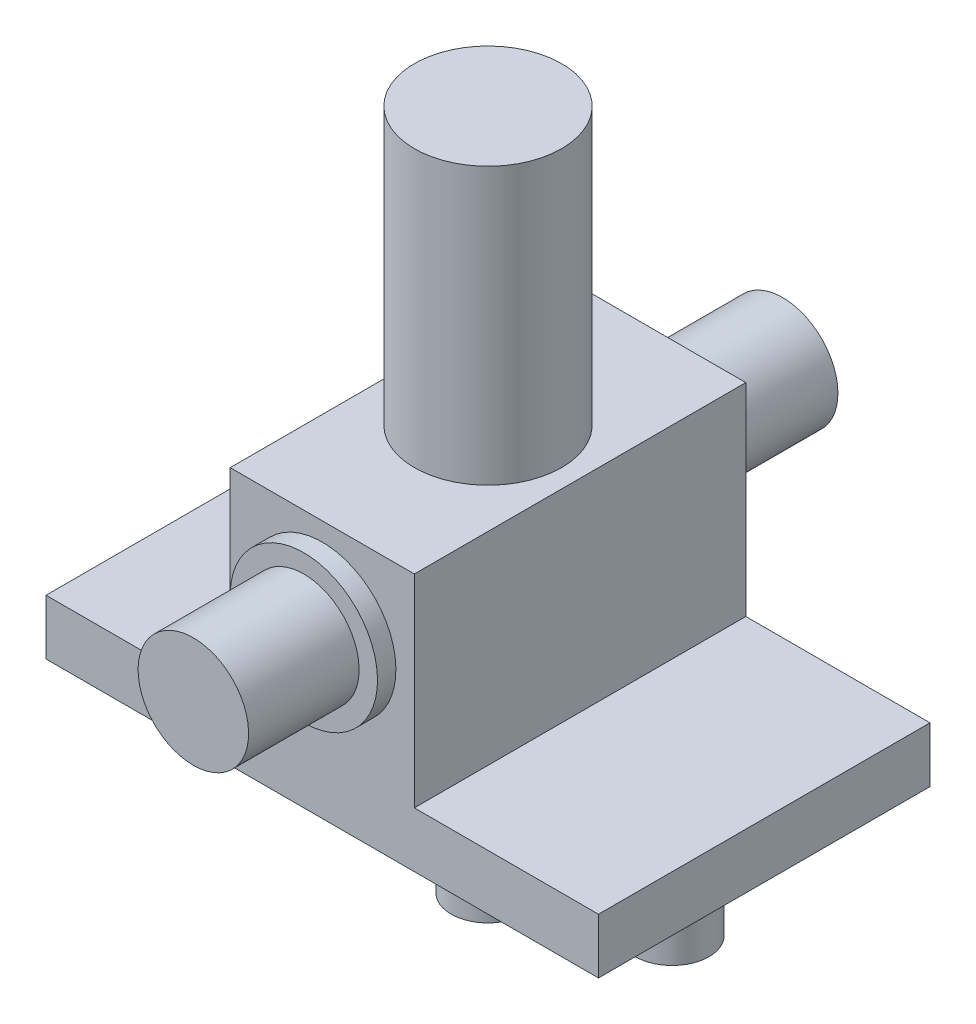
ISO-10303-21;
HEADER;
FILE_DESCRIPTION(('STEP AP214'),'2;1');
FILE_NAME('part.step','',(''),(''),'','','');
FILE_SCHEMA(('AUTOMOTIVE_DESIGN { 1 0 10303 214 1 1 1 1 }'));
ENDSEC;
DATA;
#1=APPLICATION_CONTEXT('core data for automotive mechanical design processes');
#2=APPLICATION_PROTOCOL_DEFINITION('international standard','automotive_design',2000,#1);
#3=PRODUCT_CONTEXT('',#1,'mechanical');
#4=PRODUCT('Part','Part','',(#3));
#5=PRODUCT_RELATED_PRODUCT_CATEGORY('part','',(#4));
#6=PRODUCT_DEFINITION_FORMATION('','',#4);
#7=PRODUCT_DEFINITION_CONTEXT('part definition',#1,'design');
#8=PRODUCT_DEFINITION('design','',#6,#7);
#9=PRODUCT_DEFINITION_SHAPE('','',#8);
#10=(LENGTH_UNIT() NAMED_UNIT(*) SI_UNIT(.MILLI.,.METRE.));
#11=(NAMED_UNIT(*) PLANE_ANGLE_UNIT() SI_UNIT($,.RADIAN.));
#12=(NAMED_UNIT(*) SI_UNIT($,.STERADIAN.) SOLID_ANGLE_UNIT());
#13=UNCERTAINTY_MEASURE_WITH_UNIT(LENGTH_MEASURE(1.E-05),#10,'distance_accuracy_value','');
#14=(GEOMETRIC_REPRESENTATION_CONTEXT(3) GLOBAL_UNCERTAINTY_ASSIGNED_CONTEXT((#13)) GLOBAL_UNIT_ASSIGNED_CONTEXT((#10,
#11,#12)) REPRESENTATION_CONTEXT('',''));
#15=CARTESIAN_POINT('',(0.,0.,0.));
#16=DIRECTION('',(0.,0.,1.));
#17=DIRECTION('',(1.,0.,0.));
#18=AXIS2_PLACEMENT_3D('',#15,#16,#17);
#19=CARTESIAN_POINT('',(0.,7.,0.));
#20=DIRECTION('',(0.,1.,0.));
#21=DIRECTION('',(1.,0.,0.));
#22=AXIS2_PLACEMENT_3D('',#19,#20,#21);
#23=PLANE('',#22);
#24=CARTESIAN_POINT('',(0.,7.,0.));
#25=DIRECTION('',(0.,-1.,0.));
#26=DIRECTION('',(-1.,0.,0.));
#27=AXIS2_PLACEMENT_3D('',#24,#25,#26);
#28=CIRCLE('',#27,4.);
#29=CARTESIAN_POINT('',(4.,7.,0.));
#30=VERTEX_POINT('',#29);
#31=EDGE_CURVE('E781',#30,#30,#28,.T.);
#32=ORIENTED_EDGE('',*,*,#31,.T.);
#33=EDGE_LOOP('',(#32));
#34=FACE_BOUND('',#33,.T.);
#35=DIRECTION('',(0.,0.,1.));
#36=VECTOR('',#35,1.);
#37=CARTESIAN_POINT('',(-5.,7.,-9.));
#38=LINE('',#37,#36);
#39=CARTESIAN_POINT('',(-5.,7.,-9.));
#40=VERTEX_POINT('',#39);
#41=CARTESIAN_POINT('',(-5.,7.,9.));
#42=VERTEX_POINT('',#41);
#43=EDGE_CURVE('E773',#40,#42,#38,.T.);
#44=ORIENTED_EDGE('',*,*,#43,.T.);
#45=DIRECTION('',(1.,0.,0.));
#46=VECTOR('',#45,1.);
#47=CARTESIAN_POINT('',(-5.,7.,9.));
#48=LINE('',#47,#46);
#49=CARTESIAN_POINT('',(5.,7.,9.));
#50=VERTEX_POINT('',#49);
#51=EDGE_CURVE('E252',#42,#50,#48,.T.);
#52=ORIENTED_EDGE('',*,*,#51,.T.);
#53=DIRECTION('',(0.,0.,-1.));
#54=VECTOR('',#53,1.);
#55=CARTESIAN_POINT('',(5.,7.,9.));
#56=LINE('',#55,#54);
#57=CARTESIAN_POINT('',(5.,7.,-9.));
#58=VERTEX_POINT('',#57);
#59=EDGE_CURVE('E207',#50,#58,#56,.T.);
#60=ORIENTED_EDGE('',*,*,#59,.T.);
#61=DIRECTION('',(-1.,0.,0.));
#62=VECTOR('',#61,1.);
#63=CARTESIAN_POINT('',(5.,7.,-9.));
#64=LINE('',#63,#62);
#65=EDGE_CURVE('E253',#58,#40,#64,.T.);
#66=ORIENTED_EDGE('',*,*,#65,.T.);
#67=EDGE_LOOP('',(#44,#52,#60,#66));
#68=FACE_BOUND('',#67,.T.);
#69=ADVANCED_FACE('F15',(#34,#68),#23,.T.);
#70=CARTESIAN_POINT('',(15.,-7.,0.));
#71=DIRECTION('',(0.,-1.,0.));
#72=DIRECTION('',(0.,0.,-1.));
#73=AXIS2_PLACEMENT_3D('',#70,#71,#72);
#74=PLANE('',#73);
#75=CARTESIAN_POINT('',(10.,-7.,0.));
#76=DIRECTION('',(0.,1.,0.));
#77=DIRECTION('',(-1.,0.,0.));
#78=AXIS2_PLACEMENT_3D('',#75,#76,#77);
#79=CIRCLE('',#78,3.);
#80=CARTESIAN_POINT('',(13.,-7.,0.));
#81=VERTEX_POINT('',#80);
#82=EDGE_CURVE('E299',#81,#81,#79,.T.);
#83=ORIENTED_EDGE('',*,*,#82,.T.);
#84=EDGE_LOOP('',(#83));
#85=FACE_BOUND('',#84,.T.);
#86=CARTESIAN_POINT('',(-10.,-7.,0.));
#87=DIRECTION('',(0.,1.,0.));
#88=DIRECTION('',(1.,0.,0.));
#89=AXIS2_PLACEMENT_3D('',#86,#87,#88);
#90=CIRCLE('',#89,3.);
#91=CARTESIAN_POINT('',(-13.,-7.,0.));
#92=VERTEX_POINT('',#91);
#93=EDGE_CURVE('E287',#92,#92,#90,.T.);
#94=ORIENTED_EDGE('',*,*,#93,.T.);
#95=EDGE_LOOP('',(#94));
#96=FACE_BOUND('',#95,.T.);
#97=CARTESIAN_POINT('',(0.,-7.,0.));
#98=DIRECTION('',(0.,1.,0.));
#99=DIRECTION('',(-1.,0.,0.));
#100=AXIS2_PLACEMENT_3D('',#97,#98,#99);
#101=CIRCLE('',#100,2.);
#102=CARTESIAN_POINT('',(2.,-7.,0.));
#103=VERTEX_POINT('',#102);
#104=EDGE_CURVE('E263',#103,#103,#101,.T.);
#105=ORIENTED_EDGE('',*,*,#104,.T.);
#106=EDGE_LOOP('',(#105));
#107=FACE_BOUND('',#106,.T.);
#108=DIRECTION('',(-1.,0.,0.));
#109=VECTOR('',#108,1.);
#110=CARTESIAN_POINT('',(15.,-7.,9.));
#111=LINE('',#110,#109);
#112=CARTESIAN_POINT('',(15.,-7.,9.));
#113=VERTEX_POINT('',#112);
#114=CARTESIAN_POINT('',(-15.,-7.,9.));
#115=VERTEX_POINT('',#114);
#116=EDGE_CURVE('E247',#113,#115,#111,.T.);
#117=ORIENTED_EDGE('',*,*,#116,.T.);
#118=DIRECTION('',(0.,0.,-1.));
#119=VECTOR('',#118,1.);
#120=CARTESIAN_POINT('',(-15.,-7.,9.));
#121=LINE('',#120,#119);
#122=CARTESIAN_POINT('',(-15.,-7.,-9.));
#123=VERTEX_POINT('',#122);
#124=EDGE_CURVE('E240',#115,#123,#121,.T.);
#125=ORIENTED_EDGE('',*,*,#124,.T.);
#126=DIRECTION('',(1.,0.,0.));
#127=VECTOR('',#126,1.);
#128=CARTESIAN_POINT('',(-15.,-7.,-9.));
#129=LINE('',#128,#127);
#130=CARTESIAN_POINT('',(15.,-7.,-9.));
#131=VERTEX_POINT('',#130);
#132=EDGE_CURVE('E19',#123,#131,#129,.T.);
#133=ORIENTED_EDGE('',*,*,#132,.T.);
#134=DIRECTION('',(0.,0.,-1.));
#135=VECTOR('',#134,1.);
#136=CARTESIAN_POINT('',(15.,-7.,9.));
#137=LINE('',#136,#135);
#138=EDGE_CURVE('E9',#113,#131,#137,.T.);
#139=ORIENTED_EDGE('',*,*,#138,.F.);
#140=EDGE_LOOP('',(#117,#125,#133,#139));
#141=FACE_BOUND('',#140,.T.);
#142=ADVANCED_FACE('F317',(#85,#96,#107,#141),#74,.T.);
#143=CARTESIAN_POINT('',(15.,0.,0.));
#144=DIRECTION('',(1.,0.,0.));
#145=DIRECTION('',(0.,1.,0.));
#146=AXIS2_PLACEMENT_3D('',#143,#144,#145);
#147=PLANE('',#146);
#148=DIRECTION('',(0.,0.,1.));
#149=VECTOR('',#148,1.);
#150=CARTESIAN_POINT('',(15.,-4.,-9.));
#151=LINE('',#150,#149);
#152=CARTESIAN_POINT('',(15.,-4.,-9.));
#153=VERTEX_POINT('',#152);
#154=CARTESIAN_POINT('',(15.,-4.,9.));
#155=VERTEX_POINT('',#154);
#156=EDGE_CURVE('E193',#153,#155,#151,.T.);
#157=ORIENTED_EDGE('',*,*,#156,.T.);
#158=DIRECTION('',(0.,-1.,0.));
#159=VECTOR('',#158,1.);
#160=CARTESIAN_POINT('',(15.,-4.,9.));
#161=LINE('',#160,#159);
#162=EDGE_CURVE('E188',#155,#113,#161,.T.);
#163=ORIENTED_EDGE('',*,*,#162,.T.);
#164=ORIENTED_EDGE('',*,*,#138,.T.);
#165=DIRECTION('',(0.,1.,0.));
#166=VECTOR('',#165,1.);
#167=CARTESIAN_POINT('',(15.,-7.,-9.));
#168=LINE('',#167,#166);
#169=EDGE_CURVE('E256',#131,#153,#168,.T.);
#170=ORIENTED_EDGE('',*,*,#169,.T.);
#171=EDGE_LOOP('',(#157,#163,#164,#170));
#172=FACE_BOUND('',#171,.T.);
#173=ADVANCED_FACE('F17',(#172),#147,.T.);
#174=CARTESIAN_POINT('',(0.,0.,-9.));
#175=DIRECTION('',(0.,0.,1.));
#176=DIRECTION('',(1.,0.,0.));
#177=AXIS2_PLACEMENT_3D('',#174,#175,#176);
#178=PLANE('',#177);
#179=CARTESIAN_POINT('',(0.,2.,-9.));
#180=DIRECTION('',(0.,0.,1.));
#181=DIRECTION('',(0.,-1.,0.));
#182=AXIS2_PLACEMENT_3D('',#179,#180,#181);
#183=CIRCLE('',#182,4.);
#184=CARTESIAN_POINT('',(0.,-2.,-9.));
#185=VERTEX_POINT('',#184);
#186=EDGE_CURVE('E269',#185,#185,#183,.T.);
#187=ORIENTED_EDGE('',*,*,#186,.T.);
#188=EDGE_LOOP('',(#187));
#189=FACE_BOUND('',#188,.T.);
#190=DIRECTION('',(0.,1.,0.));
#191=VECTOR('',#190,1.);
#192=CARTESIAN_POINT('',(-5.,-4.,-9.));
#193=LINE('',#192,#191);
#194=CARTESIAN_POINT('',(-5.,-4.,-9.));
#195=VERTEX_POINT('',#194);
#196=EDGE_CURVE('E229',#195,#40,#193,.T.);
#197=ORIENTED_EDGE('',*,*,#196,.T.);
#198=ORIENTED_EDGE('',*,*,#65,.F.);
#199=DIRECTION('',(0.,-1.,0.));
#200=VECTOR('',#199,1.);
#201=CARTESIAN_POINT('',(5.,7.,-9.));
#202=LINE('',#201,#200);
#203=CARTESIAN_POINT('',(5.,-4.,-9.));
#204=VERTEX_POINT('',#203);
#205=EDGE_CURVE('E214',#58,#204,#202,.T.);
#206=ORIENTED_EDGE('',*,*,#205,.T.);
#207=DIRECTION('',(1.,0.,0.));
#208=VECTOR('',#207,1.);
#209=CARTESIAN_POINT('',(5.,-4.,-9.));
#210=LINE('',#209,#208);
#211=EDGE_CURVE('E194',#204,#153,#210,.T.);
#212=ORIENTED_EDGE('',*,*,#211,.T.);
#213=ORIENTED_EDGE('',*,*,#169,.F.);
#214=ORIENTED_EDGE('',*,*,#132,.F.);
#215=DIRECTION('',(0.,-1.,0.));
#216=VECTOR('',#215,1.);
#217=CARTESIAN_POINT('',(-15.,-4.,-9.));
#218=LINE('',#217,#216);
#219=CARTESIAN_POINT('',(-15.,-4.,-9.));
#220=VERTEX_POINT('',#219);
#221=EDGE_CURVE('E236',#220,#123,#218,.T.);
#222=ORIENTED_EDGE('',*,*,#221,.F.);
#223=DIRECTION('',(1.,0.,0.));
#224=VECTOR('',#223,1.);
#225=CARTESIAN_POINT('',(-15.,-4.,-9.));
#226=LINE('',#225,#224);
#227=EDGE_CURVE('E224',#220,#195,#226,.T.);
#228=ORIENTED_EDGE('',*,*,#227,.T.);
#229=EDGE_LOOP('',(#197,#198,#206,#212,#213,#214,#222,#228));
#230=FACE_BOUND('',#229,.T.);
#231=ADVANCED_FACE('F320',(#189,#230),#178,.F.);
#232=CARTESIAN_POINT('',(0.,0.5,16.));
#233=DIRECTION('',(0.,0.,1.));
#234=DIRECTION('',(1.,0.,0.));
#235=AXIS2_PLACEMENT_3D('',#232,#233,#234);
#236=PLANE('',#235);
#237=CARTESIAN_POINT('',(0.,2.,16.));
#238=DIRECTION('',(0.,0.,1.));
#239=DIRECTION('',(0.,-1.,0.));
#240=AXIS2_PLACEMENT_3D('',#237,#238,#239);
#241=CIRCLE('',#240,3.);
#242=CARTESIAN_POINT('',(0.,-1.,16.));
#243=VERTEX_POINT('',#242);
#244=EDGE_CURVE('E43',#243,#243,#241,.T.);
#245=ORIENTED_EDGE('',*,*,#244,.T.);
#246=EDGE_LOOP('',(#245));
#247=FACE_BOUND('',#246,.T.);
#248=ADVANCED_FACE('F470',(#247),#236,.T.);
#249=CARTESIAN_POINT('',(0.,2.,13.));
#250=DIRECTION('',(0.,0.,1.));
#251=DIRECTION('',(0.,-1.,0.));
#252=AXIS2_PLACEMENT_3D('',#249,#250,#251);
#253=CYLINDRICAL_SURFACE('',#252,3.);
#254=CARTESIAN_POINT('',(0.,2.,10.));
#255=DIRECTION('',(0.,0.,1.));
#256=DIRECTION('',(0.,-1.,0.));
#257=AXIS2_PLACEMENT_3D('',#254,#255,#256);
#258=CIRCLE('',#257,3.);
#259=CARTESIAN_POINT('',(0.,-1.,10.));
#260=VERTEX_POINT('',#259);
#261=EDGE_CURVE('E305',#260,#260,#258,.T.);
#262=ORIENTED_EDGE('',*,*,#261,.T.);
#263=EDGE_LOOP('',(#262));
#264=FACE_BOUND('',#263,.T.);
#265=ORIENTED_EDGE('',*,*,#244,.F.);
#266=EDGE_LOOP('',(#265));
#267=FACE_BOUND('',#266,.T.);
#268=ADVANCED_FACE('F464',(#264,#267),#253,.T.);
#269=CARTESIAN_POINT('',(0.,-1.5,10.));
#270=DIRECTION('',(0.,0.,1.));
#271=DIRECTION('',(1.,0.,0.));
#272=AXIS2_PLACEMENT_3D('',#269,#270,#271);
#273=PLANE('',#272);
#274=ORIENTED_EDGE('',*,*,#261,.F.);
#275=EDGE_LOOP('',(#274));
#276=FACE_BOUND('',#275,.T.);
#277=CARTESIAN_POINT('',(0.,2.,10.));
#278=DIRECTION('',(0.,0.,1.));
#279=DIRECTION('',(0.,-1.,0.));
#280=AXIS2_PLACEMENT_3D('',#277,#278,#279);
#281=CIRCLE('',#280,4.);
#282=CARTESIAN_POINT('',(0.,-2.,10.));
#283=VERTEX_POINT('',#282);
#284=EDGE_CURVE('E302',#283,#283,#281,.T.);
#285=ORIENTED_EDGE('',*,*,#284,.T.);
#286=EDGE_LOOP('',(#285));
#287=FACE_BOUND('',#286,.T.);
#288=ADVANCED_FACE('F469',(#276,#287),#273,.T.);
#289=CARTESIAN_POINT('',(0.,2.,9.5));
#290=DIRECTION('',(0.,0.,1.));
#291=DIRECTION('',(0.,-1.,0.));
#292=AXIS2_PLACEMENT_3D('',#289,#290,#291);
#293=CYLINDRICAL_SURFACE('',#292,4.);
#294=CARTESIAN_POINT('',(0.,2.,9.));
#295=DIRECTION('',(0.,0.,-1.));
#296=DIRECTION('',(0.,-1.,0.));
#297=AXIS2_PLACEMENT_3D('',#294,#295,#296);
#298=CIRCLE('',#297,4.);
#299=CARTESIAN_POINT('',(0.,-2.,9.));
#300=VERTEX_POINT('',#299);
#301=EDGE_CURVE('E259',#300,#300,#298,.T.);
#302=ORIENTED_EDGE('',*,*,#301,.F.);
#303=EDGE_LOOP('',(#302));
#304=FACE_BOUND('',#303,.T.);
#305=ORIENTED_EDGE('',*,*,#284,.F.);
#306=EDGE_LOOP('',(#305));
#307=FACE_BOUND('',#306,.T.);
#308=ADVANCED_FACE('F674',(#304,#307),#293,.T.);
#309=CARTESIAN_POINT('',(10.,-8.,0.));
#310=DIRECTION('',(0.,1.,0.));
#311=DIRECTION('',(1.,0.,0.));
#312=AXIS2_PLACEMENT_3D('',#309,#310,#311);
#313=PLANE('',#312);
#314=CARTESIAN_POINT('',(10.,-8.,0.));
#315=DIRECTION('',(0.,1.,0.));
#316=DIRECTION('',(-1.,0.,0.));
#317=AXIS2_PLACEMENT_3D('',#314,#315,#316);
#318=CIRCLE('',#317,2.);
#319=CARTESIAN_POINT('',(12.,-8.,0.));
#320=VERTEX_POINT('',#319);
#321=EDGE_CURVE('E293',#320,#320,#318,.T.);
#322=ORIENTED_EDGE('',*,*,#321,.T.);
#323=EDGE_LOOP('',(#322));
#324=FACE_BOUND('',#323,.T.);
#325=CARTESIAN_POINT('',(10.,-8.,0.));
#326=DIRECTION('',(0.,1.,0.));
#327=DIRECTION('',(-1.,0.,0.));
#328=AXIS2_PLACEMENT_3D('',#325,#326,#327);
#329=CIRCLE('',#328,3.);
#330=CARTESIAN_POINT('',(13.,-8.,0.));
#331=VERTEX_POINT('',#330);
#332=EDGE_CURVE('E296',#331,#331,#329,.T.);
#333=ORIENTED_EDGE('',*,*,#332,.F.);
#334=EDGE_LOOP('',(#333));
#335=FACE_BOUND('',#334,.T.);
#336=ADVANCED_FACE('F663',(#324,#335),#313,.F.);
#337=CARTESIAN_POINT('',(10.,-7.,0.));
#338=DIRECTION('',(0.,-1.,0.));
#339=DIRECTION('',(-1.,0.,0.));
#340=AXIS2_PLACEMENT_3D('',#337,#338,#339);
#341=CYLINDRICAL_SURFACE('',#340,3.);
#342=ORIENTED_EDGE('',*,*,#82,.F.);
#343=EDGE_LOOP('',(#342));
#344=FACE_BOUND('',#343,.T.);
#345=ORIENTED_EDGE('',*,*,#332,.T.);
#346=EDGE_LOOP('',(#345));
#347=FACE_BOUND('',#346,.T.);
#348=ADVANCED_FACE('F652',(#344,#347),#341,.T.);
#349=CARTESIAN_POINT('',(10.,-12.,0.));
#350=DIRECTION('',(0.,1.,0.));
#351=DIRECTION('',(1.,0.,0.));
#352=AXIS2_PLACEMENT_3D('',#349,#350,#351);
#353=PLANE('',#352);
#354=CARTESIAN_POINT('',(10.,-12.,0.));
#355=DIRECTION('',(0.,1.,0.));
#356=DIRECTION('',(-1.,0.,0.));
#357=AXIS2_PLACEMENT_3D('',#354,#355,#356);
#358=CIRCLE('',#357,2.);
#359=CARTESIAN_POINT('',(12.,-12.,0.));
#360=VERTEX_POINT('',#359);
#361=EDGE_CURVE('E290',#360,#360,#358,.T.);
#362=ORIENTED_EDGE('',*,*,#361,.F.);
#363=EDGE_LOOP('',(#362));
#364=FACE_BOUND('',#363,.T.);
#365=ADVANCED_FACE('F641',(#364),#353,.F.);
#366=CARTESIAN_POINT('',(10.,-8.,0.));
#367=DIRECTION('',(0.,-1.,0.));
#368=DIRECTION('',(-1.,0.,0.));
#369=AXIS2_PLACEMENT_3D('',#366,#367,#368);
#370=CYLINDRICAL_SURFACE('',#369,2.);
#371=ORIENTED_EDGE('',*,*,#321,.F.);
#372=EDGE_LOOP('',(#371));
#373=FACE_BOUND('',#372,.T.);
#374=ORIENTED_EDGE('',*,*,#361,.T.);
#375=EDGE_LOOP('',(#374));
#376=FACE_BOUND('',#375,.T.);
#377=ADVANCED_FACE('F630',(#373,#376),#370,.T.);
#378=CARTESIAN_POINT('',(-13.,-8.,-3.));
#379=CARTESIAN_POINT('',(-7.,-8.,-3.));
#380=CARTESIAN_POINT('',(-13.,-8.,3.));
#381=CARTESIAN_POINT('',(-7.,-8.,3.));
#382=(BOUNDED_SURFACE() B_SPLINE_SURFACE(1,1,((#378,#379),(#380,#381)),.UNSPECIFIED.,.F.,.F.,
.F.) B_SPLINE_SURFACE_WITH_KNOTS((2,2),(2,2),(0.,6.),(0.,6.),
.UNSPECIFIED.) GEOMETRIC_REPRESENTATION_ITEM() RATIONAL_B_SPLINE_SURFACE(((1.,1.),(1.,1.))) REPRESENTATION_ITEM('') SURFACE());
#383=CARTESIAN_POINT('',(-10.,-8.,0.));
#384=DIRECTION('',(0.,-1.,0.));
#385=DIRECTION('',(1.,0.,0.));
#386=AXIS2_PLACEMENT_3D('',#383,#384,#385);
#387=CIRCLE('',#386,2.);
#388=CARTESIAN_POINT('',(-12.,-8.,0.));
#389=VERTEX_POINT('',#388);
#390=EDGE_CURVE('E281',#389,#389,#387,.T.);
#391=CARTESIAN_POINT('',(-10.,-8.,0.));
#392=DIRECTION('',(0.,-1.,0.));
#393=DIRECTION('',(1.,0.,0.));
#394=AXIS2_PLACEMENT_3D('',#391,#392,#393);
#395=CIRCLE('',#394,3.);
#396=CARTESIAN_POINT('',(-13.,-8.,0.));
#397=VERTEX_POINT('',#396);
#398=EDGE_CURVE('E284',#397,#397,#395,.T.);
#399=ORIENTED_EDGE('',*,*,#390,.F.);
#400=EDGE_LOOP('',(#399));
#401=FACE_BOUND('',#400,.T.);
#402=ORIENTED_EDGE('',*,*,#398,.T.);
#403=EDGE_LOOP('',(#402));
#404=FACE_BOUND('',#403,.T.);
#405=ADVANCED_FACE('F619',(#401,#404),#382,.F.);
#406=CARTESIAN_POINT('',(-13.,-7.,0.));
#407=CARTESIAN_POINT('',(-13.,-7.00000000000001,3.));
#408=CARTESIAN_POINT('',(-10.,-7.,3.));
#409=CARTESIAN_POINT('',(-7.00000000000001,-7.00000000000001,3.));
#410=CARTESIAN_POINT('',(-7.,-7.,0.));
#411=CARTESIAN_POINT('',(-7.00000000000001,-7.00000000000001,-2.99999999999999));
#412=CARTESIAN_POINT('',(-10.,-7.,-3.));
#413=CARTESIAN_POINT('',(-13.,-7.00000000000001,-2.99999999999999));
#414=CARTESIAN_POINT('',(-13.,-7.,0.));
#415=CARTESIAN_POINT('',(-13.,-8.,0.));
#416=CARTESIAN_POINT('',(-13.,-7.99999999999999,3.));
#417=CARTESIAN_POINT('',(-10.,-8.,3.));
#418=CARTESIAN_POINT('',(-7.00000000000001,-7.99999999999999,3.));
#419=CARTESIAN_POINT('',(-7.,-8.,0.));
#420=CARTESIAN_POINT('',(-7.00000000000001,-7.99999999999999,-2.99999999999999));
#421=CARTESIAN_POINT('',(-10.,-8.,-3.));
#422=CARTESIAN_POINT('',(-13.,-7.99999999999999,-2.99999999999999));
#423=CARTESIAN_POINT('',(-13.,-8.,0.));
#424=(BOUNDED_SURFACE() B_SPLINE_SURFACE(1,2,((#406,#407,#408,#409,#410,#411,#412,#413,#414),
(#415,#416,#417,#418,#419,#420,#421,#422,#423)),.UNSPECIFIED.,.F.,.T.,
.F.) B_SPLINE_SURFACE_WITH_KNOTS((2,2),(3,2,2,2,3),(0.,0.333333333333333),(0.,4.71238898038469,
9.42477796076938,14.1371669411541,18.8495559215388),
.UNSPECIFIED.) GEOMETRIC_REPRESENTATION_ITEM() RATIONAL_B_SPLINE_SURFACE(((1.,0.707106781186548,
1.,0.707106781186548,1.,0.707106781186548,1.,0.707106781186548,1.),(1.,0.707106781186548,1.,
0.707106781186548,1.,0.707106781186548,1.,0.707106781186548,1.))) REPRESENTATION_ITEM('') SURFACE());
#425=ORIENTED_EDGE('',*,*,#93,.F.);
#426=EDGE_LOOP('',(#425));
#427=FACE_BOUND('',#426,.T.);
#428=ORIENTED_EDGE('',*,*,#398,.F.);
#429=EDGE_LOOP('',(#428));
#430=FACE_BOUND('',#429,.T.);
#431=ADVANCED_FACE('F608',(#427,#430),#424,.T.);
#432=CARTESIAN_POINT('',(-12.,-12.,-2.));
#433=CARTESIAN_POINT('',(-8.,-12.,-2.));
#434=CARTESIAN_POINT('',(-12.,-12.,2.));
#435=CARTESIAN_POINT('',(-8.,-12.,2.));
#436=(BOUNDED_SURFACE() B_SPLINE_SURFACE(1,1,((#432,#433),(#434,#435)),.UNSPECIFIED.,.F.,.F.,
.F.) B_SPLINE_SURFACE_WITH_KNOTS((2,2),(2,2),(0.,4.),(0.,4.),
.UNSPECIFIED.) GEOMETRIC_REPRESENTATION_ITEM() RATIONAL_B_SPLINE_SURFACE(((1.,1.),(1.,1.))) REPRESENTATION_ITEM('') SURFACE());
#437=CARTESIAN_POINT('',(-10.,-12.,0.));
#438=DIRECTION('',(0.,-1.,0.));
#439=DIRECTION('',(1.,0.,0.));
#440=AXIS2_PLACEMENT_3D('',#437,#438,#439);
#441=CIRCLE('',#440,2.);
#442=CARTESIAN_POINT('',(-12.,-12.,0.));
#443=VERTEX_POINT('',#442);
#444=EDGE_CURVE('E278',#443,#443,#441,.T.);
#445=ORIENTED_EDGE('',*,*,#444,.T.);
#446=EDGE_LOOP('',(#445));
#447=FACE_BOUND('',#446,.T.);
#448=ADVANCED_FACE('F567',(#447),#436,.F.);
#449=CARTESIAN_POINT('',(-12.,-8.,0.));
#450=CARTESIAN_POINT('',(-12.,-7.99999999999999,2.));
#451=CARTESIAN_POINT('',(-10.,-8.,2.));
#452=CARTESIAN_POINT('',(-7.99999999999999,-7.99999999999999,2.));
#453=CARTESIAN_POINT('',(-8.,-8.,0.));
#454=CARTESIAN_POINT('',(-7.99999999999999,-7.99999999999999,-1.99999999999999));
#455=CARTESIAN_POINT('',(-10.,-8.,-2.));
#456=CARTESIAN_POINT('',(-12.,-7.99999999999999,-1.99999999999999));
#457=CARTESIAN_POINT('',(-12.,-8.,0.));
#458=CARTESIAN_POINT('',(-12.,-12.,0.));
#459=CARTESIAN_POINT('',(-12.,-12.,2.));
#460=CARTESIAN_POINT('',(-10.,-12.,2.));
#461=CARTESIAN_POINT('',(-7.99999999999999,-12.,2.));
#462=CARTESIAN_POINT('',(-8.,-12.,0.));
#463=CARTESIAN_POINT('',(-7.99999999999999,-12.,-1.99999999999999));
#464=CARTESIAN_POINT('',(-10.,-12.,-2.));
#465=CARTESIAN_POINT('',(-12.,-12.,-1.99999999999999));
#466=CARTESIAN_POINT('',(-12.,-12.,0.));
#467=(BOUNDED_SURFACE() B_SPLINE_SURFACE(1,2,((#449,#450,#451,#452,#453,#454,#455,#456,#457),
(#458,#459,#460,#461,#462,#463,#464,#465,#466)),.UNSPECIFIED.,.F.,.T.,
.F.) B_SPLINE_SURFACE_WITH_KNOTS((2,2),(3,2,2,2,3),(0.,2.),(0.,3.1415926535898,6.28318530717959,
9.42477796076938,12.5663706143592),
.UNSPECIFIED.) GEOMETRIC_REPRESENTATION_ITEM() RATIONAL_B_SPLINE_SURFACE(((1.,0.707106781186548,
1.,0.707106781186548,1.,0.707106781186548,1.,0.707106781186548,1.),(1.,0.707106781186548,1.,
0.707106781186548,1.,0.707106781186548,1.,0.707106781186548,1.))) REPRESENTATION_ITEM('') SURFACE());
#468=ORIENTED_EDGE('',*,*,#390,.T.);
#469=EDGE_LOOP('',(#468));
#470=FACE_BOUND('',#469,.T.);
#471=ORIENTED_EDGE('',*,*,#444,.F.);
#472=EDGE_LOOP('',(#471));
#473=FACE_BOUND('',#472,.T.);
#474=ADVANCED_FACE('F561',(#470,#473),#467,.T.);
#475=CARTESIAN_POINT('',(-3.,5.,-16.));
#476=CARTESIAN_POINT('',(-3.,-1.,-16.));
#477=CARTESIAN_POINT('',(3.,5.,-16.));
#478=CARTESIAN_POINT('',(3.,-1.,-16.));
#479=(BOUNDED_SURFACE() B_SPLINE_SURFACE(1,1,((#475,#476),(#477,#478)),.UNSPECIFIED.,.F.,.F.,
.F.) B_SPLINE_SURFACE_WITH_KNOTS((2,2),(2,2),(0.,6.),(0.,6.),
.UNSPECIFIED.) GEOMETRIC_REPRESENTATION_ITEM() RATIONAL_B_SPLINE_SURFACE(((1.,1.),(1.,1.))) REPRESENTATION_ITEM('') SURFACE());
#480=CARTESIAN_POINT('',(0.,2.,-16.));
#481=DIRECTION('',(0.,0.,1.));
#482=DIRECTION('',(0.,-1.,0.));
#483=AXIS2_PLACEMENT_3D('',#480,#481,#482);
#484=CIRCLE('',#483,3.);
#485=CARTESIAN_POINT('',(0.,-1.,-16.));
#486=VERTEX_POINT('',#485);
#487=EDGE_CURVE('E275',#486,#486,#484,.T.);
#488=ORIENTED_EDGE('',*,*,#487,.F.);
#489=EDGE_LOOP('',(#488));
#490=FACE_BOUND('',#489,.T.);
#491=ADVANCED_FACE('F566',(#490),#479,.T.);
#492=CARTESIAN_POINT('',(0.,5.,-10.));
#493=CARTESIAN_POINT('',(-3.,5.,-10.));
#494=CARTESIAN_POINT('',(-3.,2.,-10.));
#495=CARTESIAN_POINT('',(-3.,-0.999999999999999,-10.));
#496=CARTESIAN_POINT('',(0.,-1.,-10.));
#497=CARTESIAN_POINT('',(3.,-0.999999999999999,-10.));
#498=CARTESIAN_POINT('',(3.,2.,-10.));
#499=CARTESIAN_POINT('',(3.,5.,-10.));
#500=CARTESIAN_POINT('',(0.,5.,-10.));
#501=CARTESIAN_POINT('',(0.,5.,-16.));
#502=CARTESIAN_POINT('',(-3.,5.,-16.));
#503=CARTESIAN_POINT('',(-3.,2.,-16.));
#504=CARTESIAN_POINT('',(-3.,-1.,-16.));
#505=CARTESIAN_POINT('',(0.,-1.,-16.));
#506=CARTESIAN_POINT('',(3.,-1.,-16.));
#507=CARTESIAN_POINT('',(3.,2.,-16.));
#508=CARTESIAN_POINT('',(3.,5.,-16.));
#509=CARTESIAN_POINT('',(0.,5.,-16.));
#510=(BOUNDED_SURFACE() B_SPLINE_SURFACE(1,2,((#492,#493,#494,#495,#496,#497,#498,#499,#500),
(#501,#502,#503,#504,#505,#506,#507,#508,#509)),.UNSPECIFIED.,.F.,.T.,
.F.) B_SPLINE_SURFACE_WITH_KNOTS((2,2),(3,2,2,2,3),(-1.,1.),(0.,4.71238898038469,
9.42477796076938,14.1371669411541,18.8495559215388),
.UNSPECIFIED.) GEOMETRIC_REPRESENTATION_ITEM() RATIONAL_B_SPLINE_SURFACE(((1.,0.707106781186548,
1.,0.707106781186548,1.,0.707106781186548,1.,0.707106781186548,1.),(1.,0.707106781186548,1.,
0.707106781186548,1.,0.707106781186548,1.,0.707106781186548,1.))) REPRESENTATION_ITEM('') SURFACE());
#511=CARTESIAN_POINT('',(0.,2.,-10.));
#512=DIRECTION('',(0.,0.,1.));
#513=DIRECTION('',(0.,-1.,0.));
#514=AXIS2_PLACEMENT_3D('',#511,#512,#513);
#515=CIRCLE('',#514,3.);
#516=CARTESIAN_POINT('',(0.,-1.,-10.));
#517=VERTEX_POINT('',#516);
#518=EDGE_CURVE('E272',#517,#517,#515,.T.);
#519=ORIENTED_EDGE('',*,*,#518,.F.);
#520=EDGE_LOOP('',(#519));
#521=FACE_BOUND('',#520,.T.);
#522=ORIENTED_EDGE('',*,*,#487,.T.);
#523=EDGE_LOOP('',(#522));
#524=FACE_BOUND('',#523,.T.);
#525=ADVANCED_FACE('F579',(#521,#524),#510,.T.);
#526=CARTESIAN_POINT('',(-4.,6.,-10.));
#527=CARTESIAN_POINT('',(-4.,-2.,-10.));
#528=CARTESIAN_POINT('',(4.,6.,-10.));
#529=CARTESIAN_POINT('',(4.,-2.,-10.));
#530=(BOUNDED_SURFACE() B_SPLINE_SURFACE(1,1,((#526,#527),(#528,#529)),.UNSPECIFIED.,.F.,.F.,
.F.) B_SPLINE_SURFACE_WITH_KNOTS((2,2),(2,2),(0.,8.),(0.,8.),
.UNSPECIFIED.) GEOMETRIC_REPRESENTATION_ITEM() RATIONAL_B_SPLINE_SURFACE(((1.,1.),(1.,1.))) REPRESENTATION_ITEM('') SURFACE());
#531=CARTESIAN_POINT('',(0.,2.,-10.));
#532=DIRECTION('',(0.,0.,1.));
#533=DIRECTION('',(0.,-1.,0.));
#534=AXIS2_PLACEMENT_3D('',#531,#532,#533);
#535=CIRCLE('',#534,4.);
#536=CARTESIAN_POINT('',(0.,-2.,-10.));
#537=VERTEX_POINT('',#536);
#538=EDGE_CURVE('E266',#537,#537,#535,.T.);
#539=ORIENTED_EDGE('',*,*,#518,.T.);
#540=EDGE_LOOP('',(#539));
#541=FACE_BOUND('',#540,.T.);
#542=ORIENTED_EDGE('',*,*,#538,.F.);
#543=EDGE_LOOP('',(#542));
#544=FACE_BOUND('',#543,.T.);
#545=ADVANCED_FACE('F523',(#541,#544),#530,.T.);
#546=CARTESIAN_POINT('',(0.,6.,-9.));
#547=CARTESIAN_POINT('',(-4.,6.,-9.));
#548=CARTESIAN_POINT('',(-4.,2.,-9.));
#549=CARTESIAN_POINT('',(-4.,-2.,-9.));
#550=CARTESIAN_POINT('',(0.,-2.,-9.));
#551=CARTESIAN_POINT('',(4.,-2.,-9.));
#552=CARTESIAN_POINT('',(4.,2.,-9.));
#553=CARTESIAN_POINT('',(4.,6.,-9.));
#554=CARTESIAN_POINT('',(0.,6.,-9.));
#555=CARTESIAN_POINT('',(0.,6.,-10.));
#556=CARTESIAN_POINT('',(-4.,6.,-10.));
#557=CARTESIAN_POINT('',(-4.,2.,-10.));
#558=CARTESIAN_POINT('',(-4.,-2.,-10.));
#559=CARTESIAN_POINT('',(0.,-2.,-10.));
#560=CARTESIAN_POINT('',(4.,-2.,-10.));
#561=CARTESIAN_POINT('',(4.,2.,-10.));
#562=CARTESIAN_POINT('',(4.,6.,-10.));
#563=CARTESIAN_POINT('',(0.,6.,-10.));
#564=(BOUNDED_SURFACE() B_SPLINE_SURFACE(1,2,((#546,#547,#548,#549,#550,#551,#552,#553,#554),
(#555,#556,#557,#558,#559,#560,#561,#562,#563)),.UNSPECIFIED.,.F.,.T.,
.F.) B_SPLINE_SURFACE_WITH_KNOTS((2,2),(3,2,2,2,3),(-0.125,0.125),(0.,6.28318530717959,
12.5663706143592,18.8495559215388,25.1327412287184),
.UNSPECIFIED.) GEOMETRIC_REPRESENTATION_ITEM() RATIONAL_B_SPLINE_SURFACE(((1.,0.707106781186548,
1.,0.707106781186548,1.,0.707106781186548,1.,0.707106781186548,1.),(1.,0.707106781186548,1.,
0.707106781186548,1.,0.707106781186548,1.,0.707106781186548,1.))) REPRESENTATION_ITEM('') SURFACE());
#565=ORIENTED_EDGE('',*,*,#186,.F.);
#566=EDGE_LOOP('',(#565));
#567=FACE_BOUND('',#566,.T.);
#568=ORIENTED_EDGE('',*,*,#538,.T.);
#569=EDGE_LOOP('',(#568));
#570=FACE_BOUND('',#569,.T.);
#571=ADVANCED_FACE('F517',(#567,#570),#564,.T.);
#572=CARTESIAN_POINT('',(0.,-15.,0.));
#573=DIRECTION('',(0.,1.,0.));
#574=DIRECTION('',(1.,0.,0.));
#575=AXIS2_PLACEMENT_3D('',#572,#573,#574);
#576=PLANE('',#575);
#577=CARTESIAN_POINT('',(0.,-15.,0.));
#578=DIRECTION('',(0.,1.,0.));
#579=DIRECTION('',(-1.,0.,0.));
#580=AXIS2_PLACEMENT_3D('',#577,#578,#579);
#581=CIRCLE('',#580,2.);
#582=CARTESIAN_POINT('',(2.,-15.,0.));
#583=VERTEX_POINT('',#582);
#584=EDGE_CURVE('E260',#583,#583,#581,.T.);
#585=ORIENTED_EDGE('',*,*,#584,.F.);
#586=EDGE_LOOP('',(#585));
#587=FACE_BOUND('',#586,.T.);
#588=ADVANCED_FACE('F522',(#587),#576,.F.);
#589=CARTESIAN_POINT('',(0.,-7.,0.));
#590=DIRECTION('',(0.,-1.,0.));
#591=DIRECTION('',(-1.,0.,0.));
#592=AXIS2_PLACEMENT_3D('',#589,#590,#591);
#593=CYLINDRICAL_SURFACE('',#592,2.);
#594=ORIENTED_EDGE('',*,*,#104,.F.);
#595=EDGE_LOOP('',(#594));
#596=FACE_BOUND('',#595,.T.);
#597=ORIENTED_EDGE('',*,*,#584,.T.);
#598=EDGE_LOOP('',(#597));
#599=FACE_BOUND('',#598,.T.);
#600=ADVANCED_FACE('F535',(#596,#599),#593,.T.);
#601=CARTESIAN_POINT('',(0.,0.,9.));
#602=DIRECTION('',(0.,0.,1.));
#603=DIRECTION('',(1.,0.,0.));
#604=AXIS2_PLACEMENT_3D('',#601,#602,#603);
#605=PLANE('',#604);
#606=ORIENTED_EDGE('',*,*,#301,.T.);
#607=EDGE_LOOP('',(#606));
#608=FACE_BOUND('',#607,.T.);
#609=DIRECTION('',(0.,-1.,0.));
#610=VECTOR('',#609,1.);
#611=CARTESIAN_POINT('',(-5.,7.,9.));
#612=LINE('',#611,#610);
#613=CARTESIAN_POINT('',(-5.,-4.,9.));
#614=VERTEX_POINT('',#613);
#615=EDGE_CURVE('E232',#42,#614,#612,.T.);
#616=ORIENTED_EDGE('',*,*,#615,.T.);
#617=DIRECTION('',(-1.,0.,0.));
#618=VECTOR('',#617,1.);
#619=CARTESIAN_POINT('',(-5.,-4.,9.));
#620=LINE('',#619,#618);
#621=CARTESIAN_POINT('',(-15.,-4.,9.));
#622=VERTEX_POINT('',#621);
#623=EDGE_CURVE('E223',#614,#622,#620,.T.);
#624=ORIENTED_EDGE('',*,*,#623,.T.);
#625=DIRECTION('',(0.,1.,0.));
#626=VECTOR('',#625,1.);
#627=CARTESIAN_POINT('',(-15.,-7.,9.));
#628=LINE('',#627,#626);
#629=EDGE_CURVE('E244',#115,#622,#628,.T.);
#630=ORIENTED_EDGE('',*,*,#629,.F.);
#631=ORIENTED_EDGE('',*,*,#116,.F.);
#632=ORIENTED_EDGE('',*,*,#162,.F.);
#633=DIRECTION('',(-1.,0.,0.));
#634=VECTOR('',#633,1.);
#635=CARTESIAN_POINT('',(15.,-4.,9.));
#636=LINE('',#635,#634);
#637=CARTESIAN_POINT('',(5.,-4.,9.));
#638=VERTEX_POINT('',#637);
#639=EDGE_CURVE('E181',#155,#638,#636,.T.);
#640=ORIENTED_EDGE('',*,*,#639,.T.);
#641=DIRECTION('',(0.,1.,0.));
#642=VECTOR('',#641,1.);
#643=CARTESIAN_POINT('',(5.,-4.,9.));
#644=LINE('',#643,#642);
#645=EDGE_CURVE('E185',#638,#50,#644,.T.);
#646=ORIENTED_EDGE('',*,*,#645,.T.);
#647=ORIENTED_EDGE('',*,*,#51,.F.);
#648=EDGE_LOOP('',(#616,#624,#630,#631,#632,#640,#646,#647));
#649=FACE_BOUND('',#648,.T.);
#650=ADVANCED_FACE('F183',(#608,#649),#605,.T.);
#651=CARTESIAN_POINT('',(-15.,-7.,0.));
#652=DIRECTION('',(-1.,0.,0.));
#653=DIRECTION('',(0.,0.,1.));
#654=AXIS2_PLACEMENT_3D('',#651,#652,#653);
#655=PLANE('',#654);
#656=DIRECTION('',(0.,0.,-1.));
#657=VECTOR('',#656,1.);
#658=CARTESIAN_POINT('',(-15.,-4.,9.));
#659=LINE('',#658,#657);
#660=EDGE_CURVE('E219',#622,#220,#659,.T.);
#661=ORIENTED_EDGE('',*,*,#660,.T.);
#662=ORIENTED_EDGE('',*,*,#221,.T.);
#663=ORIENTED_EDGE('',*,*,#124,.F.);
#664=ORIENTED_EDGE('',*,*,#629,.T.);
#665=EDGE_LOOP('',(#661,#662,#663,#664));
#666=FACE_BOUND('',#665,.T.);
#667=ADVANCED_FACE('F432',(#666),#655,.T.);
#668=CARTESIAN_POINT('',(5.,-4.,9.));
#669=DIRECTION('',(0.,-1.,0.));
#670=DIRECTION('',(0.,0.,-1.));
#671=AXIS2_PLACEMENT_3D('',#668,#669,#670);
#672=PLANE('',#671);
#673=ORIENTED_EDGE('',*,*,#211,.F.);
#674=DIRECTION('',(0.,0.,-1.));
#675=VECTOR('',#674,1.);
#676=CARTESIAN_POINT('',(5.,-4.,9.));
#677=LINE('',#676,#675);
#678=EDGE_CURVE('E197',#638,#204,#677,.T.);
#679=ORIENTED_EDGE('',*,*,#678,.F.);
#680=ORIENTED_EDGE('',*,*,#639,.F.);
#681=ORIENTED_EDGE('',*,*,#156,.F.);
#682=EDGE_LOOP('',(#673,#679,#680,#681));
#683=FACE_BOUND('',#682,.T.);
#684=ADVANCED_FACE('F198',(#683),#672,.F.);
#685=CARTESIAN_POINT('',(5.,7.,9.));
#686=DIRECTION('',(-1.,0.,0.));
#687=DIRECTION('',(0.,0.,1.));
#688=AXIS2_PLACEMENT_3D('',#685,#686,#687);
#689=PLANE('',#688);
#690=ORIENTED_EDGE('',*,*,#205,.F.);
#691=ORIENTED_EDGE('',*,*,#59,.F.);
#692=ORIENTED_EDGE('',*,*,#645,.F.);
#693=ORIENTED_EDGE('',*,*,#678,.T.);
#694=EDGE_LOOP('',(#690,#691,#692,#693));
#695=FACE_BOUND('',#694,.T.);
#696=ADVANCED_FACE('F205',(#695),#689,.F.);
#697=CARTESIAN_POINT('',(-5.,-4.,9.));
#698=DIRECTION('',(1.,0.,0.));
#699=DIRECTION('',(0.,1.,0.));
#700=AXIS2_PLACEMENT_3D('',#697,#698,#699);
#701=PLANE('',#700);
#702=ORIENTED_EDGE('',*,*,#196,.F.);
#703=DIRECTION('',(0.,0.,-1.));
#704=VECTOR('',#703,1.);
#705=CARTESIAN_POINT('',(-5.,-4.,9.));
#706=LINE('',#705,#704);
#707=EDGE_CURVE('E228',#614,#195,#706,.T.);
#708=ORIENTED_EDGE('',*,*,#707,.F.);
#709=ORIENTED_EDGE('',*,*,#615,.F.);
#710=ORIENTED_EDGE('',*,*,#43,.F.);
#711=EDGE_LOOP('',(#702,#708,#709,#710));
#712=FACE_BOUND('',#711,.T.);
#713=ADVANCED_FACE('F482',(#712),#701,.F.);
#714=CARTESIAN_POINT('',(-15.,-4.,9.));
#715=DIRECTION('',(0.,-1.,0.));
#716=DIRECTION('',(0.,0.,-1.));
#717=AXIS2_PLACEMENT_3D('',#714,#715,#716);
#718=PLANE('',#717);
#719=ORIENTED_EDGE('',*,*,#227,.F.);
#720=ORIENTED_EDGE('',*,*,#660,.F.);
#721=ORIENTED_EDGE('',*,*,#623,.F.);
#722=ORIENTED_EDGE('',*,*,#707,.T.);
#723=EDGE_LOOP('',(#719,#720,#721,#722));
#724=FACE_BOUND('',#723,.T.);
#725=ADVANCED_FACE('F456',(#724),#718,.F.);
#726=CARTESIAN_POINT('',(0.,22.,0.));
#727=DIRECTION('',(0.,-1.,0.));
#728=DIRECTION('',(0.,0.,-1.));
#729=AXIS2_PLACEMENT_3D('',#726,#727,#728);
#730=PLANE('',#729);
#731=CARTESIAN_POINT('',(0.,22.,0.));
#732=DIRECTION('',(0.,-1.,0.));
#733=DIRECTION('',(-1.,0.,0.));
#734=AXIS2_PLACEMENT_3D('',#731,#732,#733);
#735=CIRCLE('',#734,4.);
#736=CARTESIAN_POINT('',(4.,22.,0.));
#737=VERTEX_POINT('',#736);
#738=EDGE_CURVE('E777',#737,#737,#735,.T.);
#739=ORIENTED_EDGE('',*,*,#738,.F.);
#740=EDGE_LOOP('',(#739));
#741=FACE_BOUND('',#740,.T.);
#742=ADVANCED_FACE('F445',(#741),#730,.F.);
#743=CARTESIAN_POINT('',(0.,7.,0.));
#744=DIRECTION('',(0.,1.,0.));
#745=DIRECTION('',(-1.,0.,0.));
#746=AXIS2_PLACEMENT_3D('',#743,#744,#745);
#747=CYLINDRICAL_SURFACE('',#746,4.);
#748=ORIENTED_EDGE('',*,*,#31,.F.);
#749=EDGE_LOOP('',(#748));
#750=FACE_BOUND('',#749,.T.);
#751=ORIENTED_EDGE('',*,*,#738,.T.);
#752=EDGE_LOOP('',(#751));
#753=FACE_BOUND('',#752,.T.);
#754=ADVANCED_FACE('F440',(#750,#753),#747,.T.);
#755=CLOSED_SHELL('',(#69,#142,#173,#231,#248,#268,#288,#308,#336,#348,#365,#377,#405,#431,#448,
#474,#491,#525,#545,#571,#588,#600,#650,#667,#684,#696,#713,#725,#742,#754));
#756=MANIFOLD_SOLID_BREP('B1',#755);
#757=ADVANCED_BREP_SHAPE_REPRESENTATION('',(#18,#756),#14);
#758=SHAPE_DEFINITION_REPRESENTATION(#9,#757);
ENDSEC;
END-ISO-10303-21;
